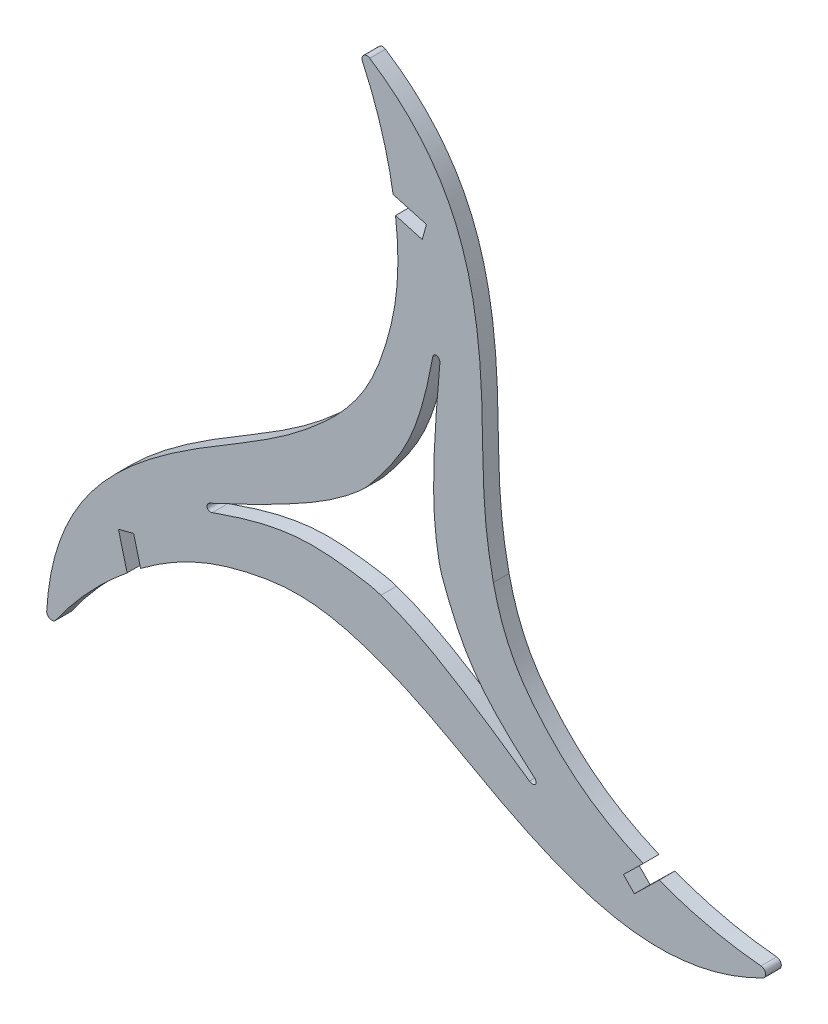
ISO-10303-21;
HEADER;
FILE_DESCRIPTION(('STEP AP214'),'2;1');
FILE_NAME('part.step','',(''),(''),'','','');
FILE_SCHEMA(('AUTOMOTIVE_DESIGN { 1 0 10303 214 1 1 1 1 }'));
ENDSEC;
DATA;
#1=APPLICATION_CONTEXT('core data for automotive mechanical design processes');
#2=APPLICATION_PROTOCOL_DEFINITION('international standard','automotive_design',2000,#1);
#3=PRODUCT_CONTEXT('',#1,'mechanical');
#4=PRODUCT('Part','Part','',(#3));
#5=PRODUCT_RELATED_PRODUCT_CATEGORY('part','',(#4));
#6=PRODUCT_DEFINITION_FORMATION('','',#4);
#7=PRODUCT_DEFINITION_CONTEXT('part definition',#1,'design');
#8=PRODUCT_DEFINITION('design','',#6,#7);
#9=PRODUCT_DEFINITION_SHAPE('','',#8);
#10=(LENGTH_UNIT() NAMED_UNIT(*) SI_UNIT(.MILLI.,.METRE.));
#11=(NAMED_UNIT(*) PLANE_ANGLE_UNIT() SI_UNIT($,.RADIAN.));
#12=(NAMED_UNIT(*) SI_UNIT($,.STERADIAN.) SOLID_ANGLE_UNIT());
#13=UNCERTAINTY_MEASURE_WITH_UNIT(LENGTH_MEASURE(1.E-05),#10,'distance_accuracy_value','');
#14=(GEOMETRIC_REPRESENTATION_CONTEXT(3) GLOBAL_UNCERTAINTY_ASSIGNED_CONTEXT((#13)) GLOBAL_UNIT_ASSIGNED_CONTEXT((#10,
#11,#12)) REPRESENTATION_CONTEXT('',''));
#15=CARTESIAN_POINT('',(0.,0.,0.));
#16=DIRECTION('',(0.,0.,1.));
#17=DIRECTION('',(1.,0.,0.));
#18=AXIS2_PLACEMENT_3D('',#15,#16,#17);
#19=CARTESIAN_POINT('',(0.926911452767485,32.4373510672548,1.5875));
#20=DIRECTION('',(0.,0.,-1.));
#21=DIRECTION('',(-1.,0.,0.));
#22=AXIS2_PLACEMENT_3D('',#19,#20,#21);
#23=PLANE('',#22);
#24=DIRECTION('',(-0.268637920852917,-0.96324123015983,0.));
#25=VECTOR('',#24,1.);
#26=CARTESIAN_POINT('',(9.20919559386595,57.6988180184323,1.5875));
#27=LINE('',#26,#25);
#28=CARTESIAN_POINT('',(9.20919559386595,57.6988180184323,1.5875));
#29=VERTEX_POINT('',#28);
#30=CARTESIAN_POINT('',(8.35627020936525,54.6405271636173,1.5875));
#31=VERTEX_POINT('',#30);
#32=EDGE_CURVE('E478',#29,#31,#27,.T.);
#33=ORIENTED_EDGE('',*,*,#32,.T.);
#34=DIRECTION('',(-0.96324123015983,0.268637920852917,0.));
#35=VECTOR('',#34,1.);
#36=CARTESIAN_POINT('',(2.96121667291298,56.1451512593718,1.5875));
#37=LINE('',#36,#35);
#38=CARTESIAN_POINT('',(2.96121667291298,56.1451512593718,1.5875));
#39=VERTEX_POINT('',#38);
#40=EDGE_CURVE('E638',#31,#39,#37,.T.);
#41=ORIENTED_EDGE('',*,*,#40,.T.);
#42=CARTESIAN_POINT('',(2.96121667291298,56.1451512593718,1.5875));
#43=CARTESIAN_POINT('',(3.0786080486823,55.1706324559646,1.5875));
#44=CARTESIAN_POINT('',(4.10490602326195,44.9116408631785,1.5875));
#45=CARTESIAN_POINT('',(1.28486234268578,31.0467796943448,1.5875));
#46=CARTESIAN_POINT('',(-4.0390919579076,19.6200508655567,1.5875));
#47=CARTESIAN_POINT('',(-11.3826186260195,12.8979686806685,1.5875));
#48=B_SPLINE_CURVE_WITH_KNOTS('',3,(#42,#43,#44,#45,#46,#47),.UNSPECIFIED.,.F.,.F.,(4,1,1,4),
(-8.31825161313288,-8.21573637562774,-7.21573637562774,-6.21573637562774),.UNSPECIFIED.);
#49=CARTESIAN_POINT('',(-11.3826186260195,12.8979686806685,1.5875));
#50=VERTEX_POINT('',#49);
#51=EDGE_CURVE('E541',#39,#50,#48,.T.);
#52=ORIENTED_EDGE('',*,*,#51,.T.);
#53=CARTESIAN_POINT('',(-11.3826186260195,12.8979686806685,1.5875));
#54=CARTESIAN_POINT('',(-19.3835443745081,5.57411968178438,1.5875));
#55=CARTESIAN_POINT('',(-34.0294843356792,-2.12221700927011,1.5875));
#56=CARTESIAN_POINT('',(-59.3228553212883,-19.5329214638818,1.5875));
#57=CARTESIAN_POINT('',(-66.9552211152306,-37.4553648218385,1.5875));
#58=CARTESIAN_POINT('',(-67.55052093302,-48.3844218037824,1.5875));
#59=B_SPLINE_CURVE_WITH_KNOTS('',3,(#53,#54,#55,#56,#57,#58),.UNSPECIFIED.,.F.,.F.,(4,1,1,4),
(-11.2199454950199,-10.2199454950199,-9.21994549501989,-8.31825161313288),.UNSPECIFIED.);
#60=CARTESIAN_POINT('',(-67.55052093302,-48.3844218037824,1.5875));
#61=VERTEX_POINT('',#60);
#62=EDGE_CURVE('E559',#50,#61,#59,.T.);
#63=ORIENTED_EDGE('',*,*,#62,.T.);
#64=CARTESIAN_POINT('',(-67.55052093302,-48.3844218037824,1.5875));
#65=CARTESIAN_POINT('',(-67.5924278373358,-49.1537869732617,1.5875));
#66=CARTESIAN_POINT('',(-66.862884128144,-49.4016678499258,1.5875));
#67=(BOUNDED_CURVE() B_SPLINE_CURVE(2,(#64,#65,#66),.UNSPECIFIED.,.F.,
.F.) B_SPLINE_CURVE_WITH_KNOTS((3,3),(0.,0.051907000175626),
.UNSPECIFIED.) CURVE() GEOMETRIC_REPRESENTATION_ITEM() RATIONAL_B_SPLINE_CURVE((1.,
0.796786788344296,1.)) REPRESENTATION_ITEM(''));
#68=CARTESIAN_POINT('',(-66.862884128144,-49.4016678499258,1.5875));
#69=VERTEX_POINT('',#68);
#70=EDGE_CURVE('E556',#61,#69,#67,.T.);
#71=ORIENTED_EDGE('',*,*,#70,.T.);
#72=CARTESIAN_POINT('',(-66.862884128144,-49.4016678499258,1.5875));
#73=CARTESIAN_POINT('',(-66.1333404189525,-49.64954872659,1.5875));
#74=CARTESIAN_POINT('',(-65.6978616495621,-49.0139095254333,1.5875));
#75=(BOUNDED_CURVE() B_SPLINE_CURVE(2,(#72,#73,#74),.UNSPECIFIED.,.F.,
.F.) B_SPLINE_CURVE_WITH_KNOTS((3,3),(0.,0.051907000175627),
.UNSPECIFIED.) CURVE() GEOMETRIC_REPRESENTATION_ITEM() RATIONAL_B_SPLINE_CURVE((1.,
0.796786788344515,1.)) REPRESENTATION_ITEM(''));
#76=CARTESIAN_POINT('',(-65.6978616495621,-49.0139095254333,1.5875));
#77=VERTEX_POINT('',#76);
#78=EDGE_CURVE('E558',#69,#77,#75,.T.);
#79=ORIENTED_EDGE('',*,*,#78,.T.);
#80=CARTESIAN_POINT('',(-65.6978616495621,-49.0139095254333,1.5875));
#81=CARTESIAN_POINT('',(-59.5706577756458,-40.2896872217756,1.5875));
#82=CARTESIAN_POINT('',(-51.3036177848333,-33.5583625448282,1.5875));
#83=(BOUNDED_CURVE() B_SPLINE_CURVE(2,(#80,#81,#82),.UNSPECIFIED.,.F.,
.F.) B_SPLINE_CURVE_WITH_KNOTS((3,3),(0.,0.83413775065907),
.UNSPECIFIED.) CURVE() GEOMETRIC_REPRESENTATION_ITEM() RATIONAL_B_SPLINE_CURVE((1.,
0.990551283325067,1.)) REPRESENTATION_ITEM(''));
#84=CARTESIAN_POINT('',(-51.3036177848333,-33.5583625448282,1.5875));
#85=VERTEX_POINT('',#84);
#86=EDGE_CURVE('E561',#77,#85,#83,.T.);
#87=ORIENTED_EDGE('',*,*,#86,.T.);
#88=DIRECTION('',(-0.248973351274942,0.968510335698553,0.));
#89=VECTOR('',#88,1.);
#90=CARTESIAN_POINT('',(-53.0457811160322,-26.7813192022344,1.5875));
#91=LINE('',#90,#89);
#92=CARTESIAN_POINT('',(-53.0457811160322,-26.7813192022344,1.5875));
#93=VERTEX_POINT('',#92);
#94=EDGE_CURVE('E582',#85,#93,#91,.T.);
#95=ORIENTED_EDGE('',*,*,#94,.T.);
#96=DIRECTION('',(0.968510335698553,0.248973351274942,0.));
#97=VECTOR('',#96,1.);
#98=CARTESIAN_POINT('',(-53.0457811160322,-26.7813192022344,1.5875));
#99=LINE('',#98,#97);
#100=CARTESIAN_POINT('',(-49.9707608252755,-25.9908288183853,1.5875));
#101=VERTEX_POINT('',#100);
#102=EDGE_CURVE('E587',#93,#101,#99,.T.);
#103=ORIENTED_EDGE('',*,*,#102,.T.);
#104=DIRECTION('',(0.248973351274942,-0.968510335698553,0.));
#105=VECTOR('',#104,1.);
#106=CARTESIAN_POINT('',(-49.9707608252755,-25.9908288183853,1.5875));
#107=LINE('',#106,#105);
#108=CARTESIAN_POINT('',(-48.5762767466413,-31.4153942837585,1.5875));
#109=VERTEX_POINT('',#108);
#110=EDGE_CURVE('E589',#101,#109,#107,.T.);
#111=ORIENTED_EDGE('',*,*,#110,.T.);
#112=CARTESIAN_POINT('',(-48.5762767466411,-31.4153942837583,1.5875));
#113=CARTESIAN_POINT('',(-47.7910143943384,-30.8264709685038,1.5875));
#114=CARTESIAN_POINT('',(-39.419616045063,-24.8081750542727,1.5875));
#115=CARTESIAN_POINT('',(-26.0022722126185,-20.3179739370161,1.5875));
#116=CARTESIAN_POINT('',(-13.4444576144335,-19.2152891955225,1.5875));
#117=CARTESIAN_POINT('',(-3.95120034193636,-22.2139287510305,1.5875));
#118=B_SPLINE_CURVE_WITH_KNOTS('',3,(#112,#113,#114,#115,#116,#117),.UNSPECIFIED.,.F.,.F.,(4,1,
1,4),(-14.7132301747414,-14.6107149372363,-13.6107149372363,-12.6107149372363),.UNSPECIFIED.);
#119=CARTESIAN_POINT('',(-3.95120034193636,-22.2139287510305,1.5875));
#120=VERTEX_POINT('',#119);
#121=EDGE_CURVE('E591',#109,#120,#118,.T.);
#122=ORIENTED_EDGE('',*,*,#121,.T.);
#123=CARTESIAN_POINT('',(-3.95120034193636,-22.2139287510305,1.5875));
#124=CARTESIAN_POINT('',(6.39190181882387,-25.4810092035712,1.5875));
#125=CARTESIAN_POINT('',(20.3800948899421,-34.3165969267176,1.5875));
#126=CARTESIAN_POINT('',(48.1048927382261,-47.5159465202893,1.5875));
#127=CARTESIAN_POINT('',(67.4423668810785,-45.1645475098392,1.5875));
#128=CARTESIAN_POINT('',(77.2048577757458,-40.2155637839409,1.5875));
#129=B_SPLINE_CURVE_WITH_KNOTS('',3,(#123,#124,#125,#126,#127,#128),.UNSPECIFIED.,.F.,.F.,(4,1,
1,4),(-17.6149240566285,-16.6149240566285,-15.6149240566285,-14.7132301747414),.UNSPECIFIED.);
#130=CARTESIAN_POINT('',(77.2048577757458,-40.2155637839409,1.5875));
#131=VERTEX_POINT('',#130);
#132=EDGE_CURVE('E596',#120,#131,#129,.T.);
#133=ORIENTED_EDGE('',*,*,#132,.T.);
#134=CARTESIAN_POINT('',(77.2048577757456,-40.2155637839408,1.5875));
#135=CARTESIAN_POINT('',(77.8921010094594,-39.867173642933,1.5875));
#136=CARTESIAN_POINT('',(77.7420002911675,-39.1114298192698,1.5875));
#137=(BOUNDED_CURVE() B_SPLINE_CURVE(2,(#134,#135,#136),.UNSPECIFIED.,.F.,
.F.) B_SPLINE_CURVE_WITH_KNOTS((3,3),(0.,0.0519070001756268),
.UNSPECIFIED.) CURVE() GEOMETRIC_REPRESENTATION_ITEM() RATIONAL_B_SPLINE_CURVE((1.,
0.796786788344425,1.)) REPRESENTATION_ITEM(''));
#138=CARTESIAN_POINT('',(77.7420002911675,-39.1114298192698,1.5875));
#139=VERTEX_POINT('',#138);
#140=EDGE_CURVE('E1062',#131,#139,#137,.T.);
#141=ORIENTED_EDGE('',*,*,#140,.T.);
#142=CARTESIAN_POINT('',(77.7420002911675,-39.1114298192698,1.5875));
#143=CARTESIAN_POINT('',(77.5918995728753,-38.3556859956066,1.5875));
#144=CARTESIAN_POINT('',(76.8236804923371,-38.2963699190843,1.5875));
#145=(BOUNDED_CURVE() B_SPLINE_CURVE(2,(#142,#143,#144),.UNSPECIFIED.,.F.,
.F.) B_SPLINE_CURVE_WITH_KNOTS((3,3),(0.,0.051907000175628),
.UNSPECIFIED.) CURVE() GEOMETRIC_REPRESENTATION_ITEM() RATIONAL_B_SPLINE_CURVE((1.,
0.796786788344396,1.)) REPRESENTATION_ITEM(''));
#146=CARTESIAN_POINT('',(76.8236804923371,-38.2963699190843,1.5875));
#147=VERTEX_POINT('',#146);
#148=EDGE_CURVE('E1079',#139,#147,#145,.T.);
#149=ORIENTED_EDGE('',*,*,#148,.T.);
#150=CARTESIAN_POINT('',(76.8236804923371,-38.2963699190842,1.5875));
#151=CARTESIAN_POINT('',(66.2046804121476,-37.3521668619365,1.5875));
#152=CARTESIAN_POINT('',(56.2416622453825,-33.5583625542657,1.5875));
#153=(BOUNDED_CURVE() B_SPLINE_CURVE(2,(#150,#151,#152),.UNSPECIFIED.,.F.,
.F.) B_SPLINE_CURVE_WITH_KNOTS((3,3),(0.,0.834137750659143),
.UNSPECIFIED.) CURVE() GEOMETRIC_REPRESENTATION_ITEM() RATIONAL_B_SPLINE_CURVE((1.,
0.990551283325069,1.)) REPRESENTATION_ITEM(''));
#154=CARTESIAN_POINT('',(56.2416622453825,-33.5583625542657,1.5875));
#155=VERTEX_POINT('',#154);
#156=EDGE_CURVE('E1054',#147,#155,#153,.T.);
#157=ORIENTED_EDGE('',*,*,#156,.T.);
#158=DIRECTION('',(-0.714267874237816,-0.699872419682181,0.));
#159=VECTOR('',#158,1.);
#160=CARTESIAN_POINT('',(51.2436522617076,-38.4556419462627,1.5875));
#161=LINE('',#160,#159);
#162=CARTESIAN_POINT('',(51.2436522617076,-38.4556419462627,1.5875));
#163=VERTEX_POINT('',#162);
#164=EDGE_CURVE('E1051',#155,#163,#161,.T.);
#165=ORIENTED_EDGE('',*,*,#164,.T.);
#166=DIRECTION('',(-0.699872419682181,0.714267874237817,0.));
#167=VECTOR('',#166,1.);
#168=CARTESIAN_POINT('',(49.0215573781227,-36.1878414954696,1.5875));
#169=LINE('',#168,#167);
#170=CARTESIAN_POINT('',(49.0215573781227,-36.1878414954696,1.5875));
#171=VERTEX_POINT('',#170);
#172=EDGE_CURVE('E1049',#163,#171,#169,.T.);
#173=ORIENTED_EDGE('',*,*,#172,.T.);
#174=DIRECTION('',(0.714267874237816,0.699872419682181,0.));
#175=VECTOR('',#174,1.);
#176=CARTESIAN_POINT('',(53.0221268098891,-32.2679000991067,1.5875));
#177=LINE('',#176,#175);
#178=CARTESIAN_POINT('',(53.0221268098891,-32.2679000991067,1.5875));
#179=VERTEX_POINT('',#178);
#180=EDGE_CURVE('E1041',#171,#179,#177,.T.);
#181=ORIENTED_EDGE('',*,*,#180,.T.);
#182=CARTESIAN_POINT('',(53.0221268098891,-32.2679000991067,1.5875));
#183=CARTESIAN_POINT('',(52.1194730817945,-31.882304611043,1.5875));
#184=CARTESIAN_POINT('',(42.7217767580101,-27.6416089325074,1.5875));
#185=CARTESIAN_POINT('',(32.1244766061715,-18.2669488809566,1.5875));
#186=CARTESIAN_POINT('',(24.8906163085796,-7.94290479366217,1.5875));
#187=CARTESIAN_POINT('',(22.7408857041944,1.7778169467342,1.5875));
#188=B_SPLINE_CURVE_WITH_KNOTS('',3,(#182,#183,#184,#185,#186,#187),.UNSPECIFIED.,.F.,.F.,(4,1,
1,4),(-21.1082087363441,-21.0056934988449,-20.0056934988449,-19.0056934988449),.UNSPECIFIED.);
#189=CARTESIAN_POINT('',(22.7408857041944,1.7778169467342,1.5875));
#190=VERTEX_POINT('',#189);
#191=EDGE_CURVE('E324',#179,#190,#188,.T.);
#192=ORIENTED_EDGE('',*,*,#191,.T.);
#193=CARTESIAN_POINT('',(22.7408857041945,1.77781694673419,1.5875));
#194=CARTESIAN_POINT('',(20.3987092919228,12.368746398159,1.5875));
#195=CARTESIAN_POINT('',(21.0564561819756,28.9006708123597,1.5875));
#196=CARTESIAN_POINT('',(18.6250293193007,59.5107248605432,1.5875));
#197=CARTESIAN_POINT('',(6.91992097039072,75.0817692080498,1.5875));
#198=CARTESIAN_POINT('',(-2.24727010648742,81.0618424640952,1.5875));
#199=B_SPLINE_CURVE_WITH_KNOTS('',3,(#193,#194,#195,#196,#197,#198),.UNSPECIFIED.,.F.,.F.,(4,1,
1,4),(-24.0099026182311,-23.0099026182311,-22.0099026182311,-21.1082087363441),.UNSPECIFIED.);
#200=CARTESIAN_POINT('',(-2.24727010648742,81.0618424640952,1.5875));
#201=VERTEX_POINT('',#200);
#202=EDGE_CURVE('E318',#190,#201,#199,.T.);
#203=ORIENTED_EDGE('',*,*,#202,.T.);
#204=CARTESIAN_POINT('',(-2.24727010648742,81.0618424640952,1.5875));
#205=CARTESIAN_POINT('',(-2.89260643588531,81.4828174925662,1.5875));
#206=CARTESIAN_POINT('',(-3.47204942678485,80.9749545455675,1.5875));
#207=(BOUNDED_CURVE() B_SPLINE_CURVE(2,(#204,#205,#206),.UNSPECIFIED.,.F.,
.F.) B_SPLINE_CURVE_WITH_KNOTS((3,3),(0.,0.0519070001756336),
.UNSPECIFIED.) CURVE() GEOMETRIC_REPRESENTATION_ITEM() RATIONAL_B_SPLINE_CURVE((1.,
0.796786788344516,1.)) REPRESENTATION_ITEM(''));
#208=CARTESIAN_POINT('',(-3.47204942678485,80.9749545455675,1.5875));
#209=VERTEX_POINT('',#208);
#210=EDGE_CURVE('E323',#201,#209,#207,.T.);
#211=ORIENTED_EDGE('',*,*,#210,.T.);
#212=CARTESIAN_POINT('',(-3.47204942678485,80.9749545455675,1.5875));
#213=CARTESIAN_POINT('',(-4.05149241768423,80.4670915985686,1.5875));
#214=CARTESIAN_POINT('',(-3.7187521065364,79.7721363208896,1.5875));
#215=(BOUNDED_CURVE() B_SPLINE_CURVE(2,(#212,#213,#214),.UNSPECIFIED.,.F.,
.F.) B_SPLINE_CURVE_WITH_KNOTS((3,3),(0.,0.051907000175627),
.UNSPECIFIED.) CURVE() GEOMETRIC_REPRESENTATION_ITEM() RATIONAL_B_SPLINE_CURVE((1.,
0.79678678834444,1.)) REPRESENTATION_ITEM(''));
#216=CARTESIAN_POINT('',(-3.7187521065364,79.7721363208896,1.5875));
#217=VERTEX_POINT('',#216);
#218=EDGE_CURVE('E335',#209,#217,#215,.T.);
#219=ORIENTED_EDGE('',*,*,#218,.T.);
#220=CARTESIAN_POINT('',(-3.7187521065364,79.7721363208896,1.5875));
#221=CARTESIAN_POINT('',(0.773044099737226,70.1037109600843,1.5875));
#222=CARTESIAN_POINT('',(2.46902227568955,59.578581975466,1.5875));
#223=(BOUNDED_CURVE() B_SPLINE_CURVE(2,(#220,#221,#222),.UNSPECIFIED.,.F.,
.F.) B_SPLINE_CURVE_WITH_KNOTS((3,3),(0.,0.83413775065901),
.UNSPECIFIED.) CURVE() GEOMETRIC_REPRESENTATION_ITEM() RATIONAL_B_SPLINE_CURVE((1.,
0.990551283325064,1.)) REPRESENTATION_ITEM(''));
#224=CARTESIAN_POINT('',(2.46902227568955,59.578581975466,1.5875));
#225=VERTEX_POINT('',#224);
#226=EDGE_CURVE('E342',#217,#225,#223,.T.);
#227=ORIENTED_EDGE('',*,*,#226,.T.);
#228=DIRECTION('',(0.96324123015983,-0.268637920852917,0.));
#229=VECTOR('',#228,1.);
#230=CARTESIAN_POINT('',(2.46902227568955,59.578581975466,1.5875));
#231=LINE('',#230,#229);
#232=EDGE_CURVE('E349',#225,#29,#231,.T.);
#233=ORIENTED_EDGE('',*,*,#232,.T.);
#234=EDGE_LOOP('',(#33,#41,#52,#63,#71,#79,#87,#95,#103,#111,#122,#133,#141,#149,#157,#165,#173,
#181,#192,#203,#211,#219,#227,#233));
#235=FACE_BOUND('',#234,.T.);
#236=CARTESIAN_POINT('',(10.4643405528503,35.0776449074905,1.5875));
#237=CARTESIAN_POINT('',(7.76222486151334,20.442368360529,1.5875));
#238=CARTESIAN_POINT('',(4.19404610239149,14.4563688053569,1.5875));
#239=CARTESIAN_POINT('',(-2.93233944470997,5.50174811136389,1.5875));
#240=CARTESIAN_POINT('',(-4.35214904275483,4.27647202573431,1.5875));
#241=B_SPLINE_CURVE_WITH_KNOTS('',3,(#236,#237,#238,#239,#240),.UNSPECIFIED.,.F.,.F.,(4,1,4),
(6.03518366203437,6.79414919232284,6.95151156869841),.UNSPECIFIED.);
#242=CARTESIAN_POINT('',(10.4643405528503,35.0776449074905,1.5875));
#243=VERTEX_POINT('',#242);
#244=CARTESIAN_POINT('',(-4.35214904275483,4.27647202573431,1.5875));
#245=VERTEX_POINT('',#244);
#246=EDGE_CURVE('E245',#243,#245,#241,.T.);
#247=ORIENTED_EDGE('',*,*,#246,.F.);
#248=CARTESIAN_POINT('',(11.9219547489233,34.7695839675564,1.5875));
#249=CARTESIAN_POINT('',(11.9355184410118,34.9201555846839,1.5875));
#250=CARTESIAN_POINT('',(12.0392274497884,36.0901645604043,1.5875));
#251=CARTESIAN_POINT('',(10.6355004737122,36.3908626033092,1.5875));
#252=CARTESIAN_POINT('',(10.4925085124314,35.2302090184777,1.5875));
#253=CARTESIAN_POINT('',(10.4643405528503,35.0776449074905,1.5875));
#254=B_SPLINE_CURVE_WITH_KNOTS('',5,(#248,#249,#250,#251,#252,#253),.UNSPECIFIED.,.F.,.F.,(6,6),
(5.03518366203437,6.03518366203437),.UNSPECIFIED.);
#255=CARTESIAN_POINT('',(11.9219547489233,34.7695839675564,1.5875));
#256=VERTEX_POINT('',#255);
#257=EDGE_CURVE('E658',#256,#243,#254,.T.);
#258=ORIENTED_EDGE('',*,*,#257,.F.);
#259=CARTESIAN_POINT('',(11.759215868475,0.,1.5875));
#260=CARTESIAN_POINT('',(10.5351236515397,6.42072739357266,1.5875));
#261=CARTESIAN_POINT('',(9.99544633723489,13.3832619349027,1.5875));
#262=CARTESIAN_POINT('',(11.9219547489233,34.7695839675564,1.5875));
#263=B_SPLINE_CURVE_WITH_KNOTS('',3,(#259,#260,#261,#262),.UNSPECIFIED.,.F.,.F.,(4,4),
(4.43391973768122,5.03518366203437),.UNSPECIFIED.);
#264=CARTESIAN_POINT('',(11.759215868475,0.,1.5875));
#265=VERTEX_POINT('',#264);
#266=EDGE_CURVE('E730',#265,#256,#263,.T.);
#267=ORIENTED_EDGE('',*,*,#266,.F.);
#268=CARTESIAN_POINT('',(31.0255692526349,-28.2320428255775,1.5875));
#269=CARTESIAN_POINT('',(19.7021058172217,-18.5743037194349,1.5875));
#270=CARTESIAN_POINT('',(16.3021675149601,-12.4911704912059,1.5875));
#271=CARTESIAN_POINT('',(12.1104312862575,-1.84222922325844,1.5875));
#272=CARTESIAN_POINT('',(11.759215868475,0.,1.5875));
#273=B_SPLINE_CURVE_WITH_KNOTS('',3,(#268,#269,#270,#271,#272),.UNSPECIFIED.,.F.,.F.,(4,1,4),
(3.51759183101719,4.27655736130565,4.43391973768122),.UNSPECIFIED.);
#274=CARTESIAN_POINT('',(31.0255692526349,-28.2320428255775,1.5875));
#275=VERTEX_POINT('',#274);
#276=EDGE_CURVE('E753',#275,#265,#273,.T.);
#277=ORIENTED_EDGE('',*,*,#276,.F.);
#278=CARTESIAN_POINT('',(30.0299735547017,-29.3403432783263,1.5875));
#279=CARTESIAN_POINT('',(30.1535905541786,-29.4273755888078,1.5875));
#280=CARTESIAN_POINT('',(31.1149935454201,-30.1021947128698,1.5875));
#281=CARTESIAN_POINT('',(32.0772691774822,-29.0368805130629,1.5875));
#282=CARTESIAN_POINT('',(31.1436096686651,-28.3327190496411,1.5875));
#283=CARTESIAN_POINT('',(31.0255692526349,-28.2320428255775,1.5875));
#284=B_SPLINE_CURVE_WITH_KNOTS('',5,(#278,#279,#280,#281,#282,#283),.UNSPECIFIED.,.F.,.F.,(6,6),
(2.51759183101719,3.51759183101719),.UNSPECIFIED.);
#285=CARTESIAN_POINT('',(30.0299735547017,-29.3403432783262,1.5875));
#286=VERTEX_POINT('',#285);
#287=EDGE_CURVE('E757',#286,#275,#284,.T.);
#288=ORIENTED_EDGE('',*,*,#287,.F.);
#289=CARTESIAN_POINT('',(0.,-11.8146152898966,1.5875));
#290=CARTESIAN_POINT('',(6.17255914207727,-13.9648840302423,1.5875));
#291=CARTESIAN_POINT('',(12.4721295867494,-16.9787770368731,1.5875));
#292=CARTESIAN_POINT('',(30.0299735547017,-29.3403432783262,1.5875));
#293=B_SPLINE_CURVE_WITH_KNOTS('',3,(#289,#290,#291,#292),.UNSPECIFIED.,.F.,.F.,(4,4),
(1.91632790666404,2.51759183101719),.UNSPECIFIED.);
#294=CARTESIAN_POINT('',(0.,-11.8146152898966,1.5875));
#295=VERTEX_POINT('',#294);
#296=EDGE_CURVE('E765',#295,#286,#293,.T.);
#297=ORIENTED_EDGE('',*,*,#296,.F.);
#298=CARTESIAN_POINT('',(-34.0828429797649,-14.3837453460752,1.5875));
#299=CARTESIAN_POINT('',(-20.0572638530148,-9.40620790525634,1.5875));
#300=CARTESIAN_POINT('',(-13.0891467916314,-9.50334157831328,1.5875));
#301=CARTESIAN_POINT('',(-1.77102501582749,-11.1976621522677,1.5875));
#302=CARTESIAN_POINT('',(0.,-11.8146152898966,1.5875));
#303=B_SPLINE_CURVE_WITH_KNOTS('',3,(#298,#299,#300,#301,#302),.UNSPECIFIED.,.F.,.F.,(4,1,4),
(1.,1.75896553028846,1.91632790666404),.UNSPECIFIED.);
#304=CARTESIAN_POINT('',(-34.0828429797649,-14.3837453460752,1.5875));
#305=VERTEX_POINT('',#304);
#306=EDGE_CURVE('E268',#305,#295,#303,.T.);
#307=ORIENTED_EDGE('',*,*,#306,.F.);
#308=CARTESIAN_POINT('',(-34.5448614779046,-12.9673839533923,1.5875));
#309=CARTESIAN_POINT('',(-34.6820421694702,-13.0309232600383,1.5875));
#310=CARTESIAN_POINT('',(-35.7471541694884,-13.5261131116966,1.5875));
#311=CARTESIAN_POINT('',(-35.3057028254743,-14.8921253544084,1.5875));
#312=CARTESIAN_POINT('',(-34.2290513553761,-14.4356332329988,1.5875));
#313=CARTESIAN_POINT('',(-34.0828429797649,-14.3837453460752,1.5875));
#314=B_SPLINE_CURVE_WITH_KNOTS('',5,(#308,#309,#310,#311,#312,#313),.UNSPECIFIED.,.F.,.F.,(6,6),
(0.,1.),.UNSPECIFIED.);
#315=CARTESIAN_POINT('',(-34.5448614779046,-12.9673839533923,1.5875));
#316=VERTEX_POINT('',#315);
#317=EDGE_CURVE('E266',#316,#305,#314,.T.);
#318=ORIENTED_EDGE('',*,*,#317,.F.);
#319=CARTESIAN_POINT('',(-4.35214904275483,4.27647202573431,1.5875));
#320=CARTESIAN_POINT('',(-9.30061596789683,0.0060133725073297,1.5875));
#321=CARTESIAN_POINT('',(-15.0605090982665,-3.94262816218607,1.5875));
#322=CARTESIAN_POINT('',(-34.5448614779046,-12.9673839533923,1.5875));
#323=B_SPLINE_CURVE_WITH_KNOTS('',3,(#319,#320,#321,#322),.UNSPECIFIED.,.F.,.F.,(4,4),
(6.95151156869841,7.55277549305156),.UNSPECIFIED.);
#324=EDGE_CURVE('E253',#245,#316,#323,.T.);
#325=ORIENTED_EDGE('',*,*,#324,.F.);
#326=EDGE_LOOP('',(#247,#258,#267,#277,#288,#297,#307,#318,#325));
#327=FACE_BOUND('',#326,.T.);
#328=ADVANCED_FACE('F30',(#235,#327),#23,.F.);
#329=CARTESIAN_POINT('',(0.926911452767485,32.4373510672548,-1.5875));
#330=DIRECTION('',(0.,0.,-1.));
#331=DIRECTION('',(-1.,0.,0.));
#332=AXIS2_PLACEMENT_3D('',#329,#330,#331);
#333=PLANE('',#332);
#334=DIRECTION('',(-0.268637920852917,-0.96324123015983,0.));
#335=VECTOR('',#334,1.);
#336=CARTESIAN_POINT('',(9.20919559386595,57.6988180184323,-1.5875));
#337=LINE('',#336,#335);
#338=CARTESIAN_POINT('',(9.20919559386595,57.6988180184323,-1.5875));
#339=VERTEX_POINT('',#338);
#340=CARTESIAN_POINT('',(8.35627020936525,54.6405271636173,-1.5875));
#341=VERTEX_POINT('',#340);
#342=EDGE_CURVE('E261',#339,#341,#337,.T.);
#343=ORIENTED_EDGE('',*,*,#342,.F.);
#344=DIRECTION('',(0.96324123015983,-0.268637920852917,0.));
#345=VECTOR('',#344,1.);
#346=CARTESIAN_POINT('',(2.46902227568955,59.578581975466,-1.5875));
#347=LINE('',#346,#345);
#348=CARTESIAN_POINT('',(2.46902227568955,59.578581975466,-1.5875));
#349=VERTEX_POINT('',#348);
#350=EDGE_CURVE('E473',#349,#339,#347,.T.);
#351=ORIENTED_EDGE('',*,*,#350,.F.);
#352=CARTESIAN_POINT('',(-3.7187521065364,79.7721363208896,-1.5875));
#353=CARTESIAN_POINT('',(0.773044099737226,70.1037109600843,-1.5875));
#354=CARTESIAN_POINT('',(2.46902227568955,59.578581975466,-1.5875));
#355=(BOUNDED_CURVE() B_SPLINE_CURVE(2,(#352,#353,#354),.UNSPECIFIED.,.F.,
.F.) B_SPLINE_CURVE_WITH_KNOTS((3,3),(0.,0.83413775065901),
.UNSPECIFIED.) CURVE() GEOMETRIC_REPRESENTATION_ITEM() RATIONAL_B_SPLINE_CURVE((1.,
0.990551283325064,1.)) REPRESENTATION_ITEM(''));
#356=CARTESIAN_POINT('',(-3.7187521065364,79.7721363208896,-1.5875));
#357=VERTEX_POINT('',#356);
#358=EDGE_CURVE('E466',#357,#349,#355,.T.);
#359=ORIENTED_EDGE('',*,*,#358,.F.);
#360=CARTESIAN_POINT('',(-3.47204942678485,80.9749545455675,-1.5875));
#361=CARTESIAN_POINT('',(-4.05149241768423,80.4670915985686,-1.5875));
#362=CARTESIAN_POINT('',(-3.7187521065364,79.7721363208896,-1.5875));
#363=(BOUNDED_CURVE() B_SPLINE_CURVE(2,(#360,#361,#362),.UNSPECIFIED.,.F.,
.F.) B_SPLINE_CURVE_WITH_KNOTS((3,3),(0.,0.051907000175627),
.UNSPECIFIED.) CURVE() GEOMETRIC_REPRESENTATION_ITEM() RATIONAL_B_SPLINE_CURVE((1.,
0.79678678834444,1.)) REPRESENTATION_ITEM(''));
#364=CARTESIAN_POINT('',(-3.47204942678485,80.9749545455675,-1.5875));
#365=VERTEX_POINT('',#364);
#366=EDGE_CURVE('E459',#365,#357,#363,.T.);
#367=ORIENTED_EDGE('',*,*,#366,.F.);
#368=CARTESIAN_POINT('',(-2.24727010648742,81.0618424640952,-1.5875));
#369=CARTESIAN_POINT('',(-2.89260643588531,81.4828174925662,-1.5875));
#370=CARTESIAN_POINT('',(-3.47204942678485,80.9749545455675,-1.5875));
#371=(BOUNDED_CURVE() B_SPLINE_CURVE(2,(#368,#369,#370),.UNSPECIFIED.,.F.,
.F.) B_SPLINE_CURVE_WITH_KNOTS((3,3),(0.,0.0519070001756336),
.UNSPECIFIED.) CURVE() GEOMETRIC_REPRESENTATION_ITEM() RATIONAL_B_SPLINE_CURVE((1.,
0.796786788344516,1.)) REPRESENTATION_ITEM(''));
#372=CARTESIAN_POINT('',(-2.24727010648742,81.0618424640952,-1.5875));
#373=VERTEX_POINT('',#372);
#374=EDGE_CURVE('E452',#373,#365,#371,.T.);
#375=ORIENTED_EDGE('',*,*,#374,.F.);
#376=CARTESIAN_POINT('',(22.7408857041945,1.77781694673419,-1.5875));
#377=CARTESIAN_POINT('',(20.3987092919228,12.368746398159,-1.5875));
#378=CARTESIAN_POINT('',(21.0564561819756,28.9006708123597,-1.5875));
#379=CARTESIAN_POINT('',(18.6250293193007,59.5107248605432,-1.5875));
#380=CARTESIAN_POINT('',(6.91992097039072,75.0817692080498,-1.5875));
#381=CARTESIAN_POINT('',(-2.24727010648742,81.0618424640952,-1.5875));
#382=B_SPLINE_CURVE_WITH_KNOTS('',3,(#376,#377,#378,#379,#380,#381),.UNSPECIFIED.,.F.,.F.,(4,1,
1,4),(-24.0099026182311,-23.0099026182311,-22.0099026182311,-21.1082087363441),.UNSPECIFIED.);
#383=CARTESIAN_POINT('',(22.7408857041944,1.7778169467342,-1.5875));
#384=VERTEX_POINT('',#383);
#385=EDGE_CURVE('E445',#384,#373,#382,.T.);
#386=ORIENTED_EDGE('',*,*,#385,.F.);
#387=CARTESIAN_POINT('',(53.0221268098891,-32.2679000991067,-1.5875));
#388=CARTESIAN_POINT('',(52.1194730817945,-31.882304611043,-1.5875));
#389=CARTESIAN_POINT('',(42.7217767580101,-27.6416089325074,-1.5875));
#390=CARTESIAN_POINT('',(32.1244766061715,-18.2669488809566,-1.5875));
#391=CARTESIAN_POINT('',(24.8906163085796,-7.94290479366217,-1.5875));
#392=CARTESIAN_POINT('',(22.7408857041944,1.7778169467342,-1.5875));
#393=B_SPLINE_CURVE_WITH_KNOTS('',3,(#387,#388,#389,#390,#391,#392),.UNSPECIFIED.,.F.,.F.,(4,1,
1,4),(-21.1082087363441,-21.0056934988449,-20.0056934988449,-19.0056934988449),.UNSPECIFIED.);
#394=CARTESIAN_POINT('',(53.0221268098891,-32.2679000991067,-1.5875));
#395=VERTEX_POINT('',#394);
#396=EDGE_CURVE('E441',#395,#384,#393,.T.);
#397=ORIENTED_EDGE('',*,*,#396,.F.);
#398=DIRECTION('',(0.714267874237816,0.699872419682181,0.));
#399=VECTOR('',#398,1.);
#400=CARTESIAN_POINT('',(53.0221268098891,-32.2679000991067,-1.5875));
#401=LINE('',#400,#399);
#402=CARTESIAN_POINT('',(49.0215573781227,-36.1878414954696,-1.5875));
#403=VERTEX_POINT('',#402);
#404=EDGE_CURVE('E439',#403,#395,#401,.T.);
#405=ORIENTED_EDGE('',*,*,#404,.F.);
#406=DIRECTION('',(-0.699872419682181,0.714267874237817,0.));
#407=VECTOR('',#406,1.);
#408=CARTESIAN_POINT('',(49.0215573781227,-36.1878414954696,-1.5875));
#409=LINE('',#408,#407);
#410=CARTESIAN_POINT('',(51.2436522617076,-38.4556419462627,-1.5875));
#411=VERTEX_POINT('',#410);
#412=EDGE_CURVE('E437',#411,#403,#409,.T.);
#413=ORIENTED_EDGE('',*,*,#412,.F.);
#414=DIRECTION('',(-0.714267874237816,-0.699872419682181,0.));
#415=VECTOR('',#414,1.);
#416=CARTESIAN_POINT('',(51.2436522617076,-38.4556419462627,-1.5875));
#417=LINE('',#416,#415);
#418=CARTESIAN_POINT('',(56.2416622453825,-33.5583625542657,-1.5875));
#419=VERTEX_POINT('',#418);
#420=EDGE_CURVE('E432',#419,#411,#417,.T.);
#421=ORIENTED_EDGE('',*,*,#420,.F.);
#422=CARTESIAN_POINT('',(76.8236804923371,-38.2963699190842,-1.5875));
#423=CARTESIAN_POINT('',(66.2046804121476,-37.3521668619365,-1.5875));
#424=CARTESIAN_POINT('',(56.2416622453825,-33.5583625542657,-1.5875));
#425=(BOUNDED_CURVE() B_SPLINE_CURVE(2,(#422,#423,#424),.UNSPECIFIED.,.F.,
.F.) B_SPLINE_CURVE_WITH_KNOTS((3,3),(0.,0.834137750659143),
.UNSPECIFIED.) CURVE() GEOMETRIC_REPRESENTATION_ITEM() RATIONAL_B_SPLINE_CURVE((1.,
0.990551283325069,1.)) REPRESENTATION_ITEM(''));
#426=CARTESIAN_POINT('',(76.8236804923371,-38.2963699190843,-1.5875));
#427=VERTEX_POINT('',#426);
#428=EDGE_CURVE('E425',#427,#419,#425,.T.);
#429=ORIENTED_EDGE('',*,*,#428,.F.);
#430=CARTESIAN_POINT('',(77.7420002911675,-39.1114298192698,-1.5875));
#431=CARTESIAN_POINT('',(77.5918995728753,-38.3556859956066,-1.5875));
#432=CARTESIAN_POINT('',(76.8236804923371,-38.2963699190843,-1.5875));
#433=(BOUNDED_CURVE() B_SPLINE_CURVE(2,(#430,#431,#432),.UNSPECIFIED.,.F.,
.F.) B_SPLINE_CURVE_WITH_KNOTS((3,3),(0.,0.051907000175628),
.UNSPECIFIED.) CURVE() GEOMETRIC_REPRESENTATION_ITEM() RATIONAL_B_SPLINE_CURVE((1.,
0.796786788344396,1.)) REPRESENTATION_ITEM(''));
#434=CARTESIAN_POINT('',(77.7420002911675,-39.1114298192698,-1.5875));
#435=VERTEX_POINT('',#434);
#436=EDGE_CURVE('E418',#435,#427,#433,.T.);
#437=ORIENTED_EDGE('',*,*,#436,.F.);
#438=CARTESIAN_POINT('',(77.2048577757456,-40.2155637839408,-1.5875));
#439=CARTESIAN_POINT('',(77.8921010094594,-39.867173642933,-1.5875));
#440=CARTESIAN_POINT('',(77.7420002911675,-39.1114298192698,-1.5875));
#441=(BOUNDED_CURVE() B_SPLINE_CURVE(2,(#438,#439,#440),.UNSPECIFIED.,.F.,
.F.) B_SPLINE_CURVE_WITH_KNOTS((3,3),(0.,0.0519070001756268),
.UNSPECIFIED.) CURVE() GEOMETRIC_REPRESENTATION_ITEM() RATIONAL_B_SPLINE_CURVE((1.,
0.796786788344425,1.)) REPRESENTATION_ITEM(''));
#442=CARTESIAN_POINT('',(77.2048577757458,-40.2155637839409,-1.5875));
#443=VERTEX_POINT('',#442);
#444=EDGE_CURVE('E411',#443,#435,#441,.T.);
#445=ORIENTED_EDGE('',*,*,#444,.F.);
#446=CARTESIAN_POINT('',(-3.95120034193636,-22.2139287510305,-1.5875));
#447=CARTESIAN_POINT('',(6.39190181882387,-25.4810092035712,-1.5875));
#448=CARTESIAN_POINT('',(20.3800948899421,-34.3165969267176,-1.5875));
#449=CARTESIAN_POINT('',(48.1048927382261,-47.5159465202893,-1.5875));
#450=CARTESIAN_POINT('',(67.4423668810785,-45.1645475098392,-1.5875));
#451=CARTESIAN_POINT('',(77.2048577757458,-40.2155637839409,-1.5875));
#452=B_SPLINE_CURVE_WITH_KNOTS('',3,(#446,#447,#448,#449,#450,#451),.UNSPECIFIED.,.F.,.F.,(4,1,
1,4),(-17.6149240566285,-16.6149240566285,-15.6149240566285,-14.7132301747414),.UNSPECIFIED.);
#453=CARTESIAN_POINT('',(-3.95120034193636,-22.2139287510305,-1.5875));
#454=VERTEX_POINT('',#453);
#455=EDGE_CURVE('E404',#454,#443,#452,.T.);
#456=ORIENTED_EDGE('',*,*,#455,.F.);
#457=CARTESIAN_POINT('',(-48.5762767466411,-31.4153942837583,-1.5875));
#458=CARTESIAN_POINT('',(-47.7910143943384,-30.8264709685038,-1.5875));
#459=CARTESIAN_POINT('',(-39.419616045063,-24.8081750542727,-1.5875));
#460=CARTESIAN_POINT('',(-26.0022722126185,-20.3179739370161,-1.5875));
#461=CARTESIAN_POINT('',(-13.4444576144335,-19.2152891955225,-1.5875));
#462=CARTESIAN_POINT('',(-3.95120034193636,-22.2139287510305,-1.5875));
#463=B_SPLINE_CURVE_WITH_KNOTS('',3,(#457,#458,#459,#460,#461,#462),.UNSPECIFIED.,.F.,.F.,(4,1,
1,4),(-14.7132301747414,-14.6107149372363,-13.6107149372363,-12.6107149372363),.UNSPECIFIED.);
#464=CARTESIAN_POINT('',(-48.5762767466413,-31.4153942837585,-1.5875));
#465=VERTEX_POINT('',#464);
#466=EDGE_CURVE('E400',#465,#454,#463,.T.);
#467=ORIENTED_EDGE('',*,*,#466,.F.);
#468=DIRECTION('',(0.248973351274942,-0.968510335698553,0.));
#469=VECTOR('',#468,1.);
#470=CARTESIAN_POINT('',(-49.9707608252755,-25.9908288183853,-1.5875));
#471=LINE('',#470,#469);
#472=CARTESIAN_POINT('',(-49.9707608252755,-25.9908288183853,-1.5875));
#473=VERTEX_POINT('',#472);
#474=EDGE_CURVE('E398',#473,#465,#471,.T.);
#475=ORIENTED_EDGE('',*,*,#474,.F.);
#476=DIRECTION('',(0.968510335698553,0.248973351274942,0.));
#477=VECTOR('',#476,1.);
#478=CARTESIAN_POINT('',(-53.0457811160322,-26.7813192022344,-1.5875));
#479=LINE('',#478,#477);
#480=CARTESIAN_POINT('',(-53.0457811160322,-26.7813192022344,-1.5875));
#481=VERTEX_POINT('',#480);
#482=EDGE_CURVE('E396',#481,#473,#479,.T.);
#483=ORIENTED_EDGE('',*,*,#482,.F.);
#484=DIRECTION('',(-0.248973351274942,0.968510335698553,0.));
#485=VECTOR('',#484,1.);
#486=CARTESIAN_POINT('',(-53.0457811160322,-26.7813192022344,-1.5875));
#487=LINE('',#486,#485);
#488=CARTESIAN_POINT('',(-51.3036177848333,-33.5583625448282,-1.5875));
#489=VERTEX_POINT('',#488);
#490=EDGE_CURVE('E391',#489,#481,#487,.T.);
#491=ORIENTED_EDGE('',*,*,#490,.F.);
#492=CARTESIAN_POINT('',(-65.6978616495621,-49.0139095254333,-1.5875));
#493=CARTESIAN_POINT('',(-59.5706577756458,-40.2896872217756,-1.5875));
#494=CARTESIAN_POINT('',(-51.3036177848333,-33.5583625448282,-1.5875));
#495=(BOUNDED_CURVE() B_SPLINE_CURVE(2,(#492,#493,#494),.UNSPECIFIED.,.F.,
.F.) B_SPLINE_CURVE_WITH_KNOTS((3,3),(0.,0.83413775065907),
.UNSPECIFIED.) CURVE() GEOMETRIC_REPRESENTATION_ITEM() RATIONAL_B_SPLINE_CURVE((1.,
0.990551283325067,1.)) REPRESENTATION_ITEM(''));
#496=CARTESIAN_POINT('',(-65.6978616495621,-49.0139095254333,-1.5875));
#497=VERTEX_POINT('',#496);
#498=EDGE_CURVE('E384',#497,#489,#495,.T.);
#499=ORIENTED_EDGE('',*,*,#498,.F.);
#500=CARTESIAN_POINT('',(-66.862884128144,-49.4016678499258,-1.5875));
#501=CARTESIAN_POINT('',(-66.1333404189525,-49.64954872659,-1.5875));
#502=CARTESIAN_POINT('',(-65.6978616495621,-49.0139095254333,-1.5875));
#503=(BOUNDED_CURVE() B_SPLINE_CURVE(2,(#500,#501,#502),.UNSPECIFIED.,.F.,
.F.) B_SPLINE_CURVE_WITH_KNOTS((3,3),(0.,0.051907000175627),
.UNSPECIFIED.) CURVE() GEOMETRIC_REPRESENTATION_ITEM() RATIONAL_B_SPLINE_CURVE((1.,
0.796786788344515,1.)) REPRESENTATION_ITEM(''));
#504=CARTESIAN_POINT('',(-66.862884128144,-49.4016678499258,-1.5875));
#505=VERTEX_POINT('',#504);
#506=EDGE_CURVE('E377',#505,#497,#503,.T.);
#507=ORIENTED_EDGE('',*,*,#506,.F.);
#508=CARTESIAN_POINT('',(-67.55052093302,-48.3844218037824,-1.5875));
#509=CARTESIAN_POINT('',(-67.5924278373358,-49.1537869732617,-1.5875));
#510=CARTESIAN_POINT('',(-66.862884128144,-49.4016678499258,-1.5875));
#511=(BOUNDED_CURVE() B_SPLINE_CURVE(2,(#508,#509,#510),.UNSPECIFIED.,.F.,
.F.) B_SPLINE_CURVE_WITH_KNOTS((3,3),(0.,0.051907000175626),
.UNSPECIFIED.) CURVE() GEOMETRIC_REPRESENTATION_ITEM() RATIONAL_B_SPLINE_CURVE((1.,
0.796786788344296,1.)) REPRESENTATION_ITEM(''));
#512=CARTESIAN_POINT('',(-67.55052093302,-48.3844218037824,-1.5875));
#513=VERTEX_POINT('',#512);
#514=EDGE_CURVE('E370',#513,#505,#511,.T.);
#515=ORIENTED_EDGE('',*,*,#514,.F.);
#516=CARTESIAN_POINT('',(-11.3826186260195,12.8979686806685,-1.5875));
#517=CARTESIAN_POINT('',(-19.3835443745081,5.57411968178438,-1.5875));
#518=CARTESIAN_POINT('',(-34.0294843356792,-2.12221700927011,-1.5875));
#519=CARTESIAN_POINT('',(-59.3228553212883,-19.5329214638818,-1.5875));
#520=CARTESIAN_POINT('',(-66.9552211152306,-37.4553648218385,-1.5875));
#521=CARTESIAN_POINT('',(-67.55052093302,-48.3844218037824,-1.5875));
#522=B_SPLINE_CURVE_WITH_KNOTS('',3,(#516,#517,#518,#519,#520,#521),.UNSPECIFIED.,.F.,.F.,(4,1,
1,4),(-11.2199454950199,-10.2199454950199,-9.21994549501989,-8.31825161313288),.UNSPECIFIED.);
#523=CARTESIAN_POINT('',(-11.3826186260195,12.8979686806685,-1.5875));
#524=VERTEX_POINT('',#523);
#525=EDGE_CURVE('E363',#524,#513,#522,.T.);
#526=ORIENTED_EDGE('',*,*,#525,.F.);
#527=CARTESIAN_POINT('',(2.96121667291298,56.1451512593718,-1.5875));
#528=CARTESIAN_POINT('',(3.0786080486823,55.1706324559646,-1.5875));
#529=CARTESIAN_POINT('',(4.10490602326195,44.9116408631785,-1.5875));
#530=CARTESIAN_POINT('',(1.28486234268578,31.0467796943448,-1.5875));
#531=CARTESIAN_POINT('',(-4.0390919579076,19.6200508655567,-1.5875));
#532=CARTESIAN_POINT('',(-11.3826186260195,12.8979686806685,-1.5875));
#533=B_SPLINE_CURVE_WITH_KNOTS('',3,(#527,#528,#529,#530,#531,#532),.UNSPECIFIED.,.F.,.F.,(4,1,
1,4),(-8.31825161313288,-8.21573637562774,-7.21573637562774,-6.21573637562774),.UNSPECIFIED.);
#534=CARTESIAN_POINT('',(2.96121667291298,56.1451512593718,-1.5875));
#535=VERTEX_POINT('',#534);
#536=EDGE_CURVE('E359',#535,#524,#533,.T.);
#537=ORIENTED_EDGE('',*,*,#536,.F.);
#538=DIRECTION('',(-0.96324123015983,0.268637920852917,0.));
#539=VECTOR('',#538,1.);
#540=CARTESIAN_POINT('',(2.96121667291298,56.1451512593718,-1.5875));
#541=LINE('',#540,#539);
#542=EDGE_CURVE('E357',#341,#535,#541,.T.);
#543=ORIENTED_EDGE('',*,*,#542,.F.);
#544=EDGE_LOOP('',(#343,#351,#359,#367,#375,#386,#397,#405,#413,#421,#429,#437,#445,#456,#467,
#475,#483,#491,#499,#507,#515,#526,#537,#543));
#545=FACE_BOUND('',#544,.T.);
#546=CARTESIAN_POINT('',(11.9219547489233,34.7695839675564,-1.5875));
#547=CARTESIAN_POINT('',(11.9355184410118,34.9201555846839,-1.5875));
#548=CARTESIAN_POINT('',(12.0392274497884,36.0901645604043,-1.5875));
#549=CARTESIAN_POINT('',(10.6355004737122,36.3908626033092,-1.5875));
#550=CARTESIAN_POINT('',(10.4925085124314,35.2302090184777,-1.5875));
#551=CARTESIAN_POINT('',(10.4643405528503,35.0776449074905,-1.5875));
#552=B_SPLINE_CURVE_WITH_KNOTS('',5,(#546,#547,#548,#549,#550,#551),.UNSPECIFIED.,.F.,.F.,(6,6),
(5.03518366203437,6.03518366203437),.UNSPECIFIED.);
#553=CARTESIAN_POINT('',(11.9219547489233,34.7695839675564,-1.5875));
#554=VERTEX_POINT('',#553);
#555=CARTESIAN_POINT('',(10.4643405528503,35.0776449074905,-1.5875));
#556=VERTEX_POINT('',#555);
#557=EDGE_CURVE('E254',#554,#556,#552,.T.);
#558=ORIENTED_EDGE('',*,*,#557,.T.);
#559=CARTESIAN_POINT('',(10.4643405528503,35.0776449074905,-1.5875));
#560=CARTESIAN_POINT('',(7.76222486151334,20.442368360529,-1.5875));
#561=CARTESIAN_POINT('',(4.19404610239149,14.4563688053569,-1.5875));
#562=CARTESIAN_POINT('',(-2.93233944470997,5.50174811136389,-1.5875));
#563=CARTESIAN_POINT('',(-4.35214904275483,4.27647202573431,-1.5875));
#564=B_SPLINE_CURVE_WITH_KNOTS('',3,(#559,#560,#561,#562,#563),.UNSPECIFIED.,.F.,.F.,(4,1,4),
(6.03518366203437,6.79414919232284,6.95151156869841),.UNSPECIFIED.);
#565=CARTESIAN_POINT('',(-4.35214904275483,4.27647202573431,-1.5875));
#566=VERTEX_POINT('',#565);
#567=EDGE_CURVE('E53',#556,#566,#564,.T.);
#568=ORIENTED_EDGE('',*,*,#567,.T.);
#569=CARTESIAN_POINT('',(-4.35214904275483,4.27647202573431,-1.5875));
#570=CARTESIAN_POINT('',(-9.30061596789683,0.0060133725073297,-1.5875));
#571=CARTESIAN_POINT('',(-15.0605090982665,-3.94262816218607,-1.5875));
#572=CARTESIAN_POINT('',(-34.5448614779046,-12.9673839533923,-1.5875));
#573=B_SPLINE_CURVE_WITH_KNOTS('',3,(#569,#570,#571,#572),.UNSPECIFIED.,.F.,.F.,(4,4),
(6.95151156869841,7.55277549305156),.UNSPECIFIED.);
#574=CARTESIAN_POINT('',(-34.5448614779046,-12.9673839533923,-1.5875));
#575=VERTEX_POINT('',#574);
#576=EDGE_CURVE('E260',#566,#575,#573,.T.);
#577=ORIENTED_EDGE('',*,*,#576,.T.);
#578=CARTESIAN_POINT('',(-34.5448614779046,-12.9673839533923,-1.5875));
#579=CARTESIAN_POINT('',(-34.6820421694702,-13.0309232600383,-1.5875));
#580=CARTESIAN_POINT('',(-35.7471541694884,-13.5261131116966,-1.5875));
#581=CARTESIAN_POINT('',(-35.3057028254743,-14.8921253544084,-1.5875));
#582=CARTESIAN_POINT('',(-34.2290513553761,-14.4356332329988,-1.5875));
#583=CARTESIAN_POINT('',(-34.0828429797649,-14.3837453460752,-1.5875));
#584=B_SPLINE_CURVE_WITH_KNOTS('',5,(#578,#579,#580,#581,#582,#583),.UNSPECIFIED.,.F.,.F.,(6,6),
(0.,1.),.UNSPECIFIED.);
#585=CARTESIAN_POINT('',(-34.0828429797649,-14.3837453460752,-1.5875));
#586=VERTEX_POINT('',#585);
#587=EDGE_CURVE('E703',#575,#586,#584,.T.);
#588=ORIENTED_EDGE('',*,*,#587,.T.);
#589=CARTESIAN_POINT('',(-34.0828429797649,-14.3837453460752,-1.5875));
#590=CARTESIAN_POINT('',(-20.0572638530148,-9.40620790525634,-1.5875));
#591=CARTESIAN_POINT('',(-13.0891467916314,-9.50334157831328,-1.5875));
#592=CARTESIAN_POINT('',(-1.77102501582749,-11.1976621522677,-1.5875));
#593=CARTESIAN_POINT('',(0.,-11.8146152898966,-1.5875));
#594=B_SPLINE_CURVE_WITH_KNOTS('',3,(#589,#590,#591,#592,#593),.UNSPECIFIED.,.F.,.F.,(4,1,4),
(1.,1.75896553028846,1.91632790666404),.UNSPECIFIED.);
#595=CARTESIAN_POINT('',(0.,-11.8146152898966,-1.5875));
#596=VERTEX_POINT('',#595);
#597=EDGE_CURVE('E695',#586,#596,#594,.T.);
#598=ORIENTED_EDGE('',*,*,#597,.T.);
#599=CARTESIAN_POINT('',(0.,-11.8146152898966,-1.5875));
#600=CARTESIAN_POINT('',(6.17255914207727,-13.9648840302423,-1.5875));
#601=CARTESIAN_POINT('',(12.4721295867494,-16.9787770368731,-1.5875));
#602=CARTESIAN_POINT('',(30.0299735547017,-29.3403432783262,-1.5875));
#603=B_SPLINE_CURVE_WITH_KNOTS('',3,(#599,#600,#601,#602),.UNSPECIFIED.,.F.,.F.,(4,4),
(1.91632790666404,2.51759183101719),.UNSPECIFIED.);
#604=CARTESIAN_POINT('',(30.0299735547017,-29.3403432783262,-1.5875));
#605=VERTEX_POINT('',#604);
#606=EDGE_CURVE('E687',#596,#605,#603,.T.);
#607=ORIENTED_EDGE('',*,*,#606,.T.);
#608=CARTESIAN_POINT('',(30.0299735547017,-29.3403432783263,-1.5875));
#609=CARTESIAN_POINT('',(30.1535905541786,-29.4273755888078,-1.5875));
#610=CARTESIAN_POINT('',(31.1149935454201,-30.1021947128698,-1.5875));
#611=CARTESIAN_POINT('',(32.0772691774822,-29.0368805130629,-1.5875));
#612=CARTESIAN_POINT('',(31.1436096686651,-28.3327190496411,-1.5875));
#613=CARTESIAN_POINT('',(31.0255692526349,-28.2320428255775,-1.5875));
#614=B_SPLINE_CURVE_WITH_KNOTS('',5,(#608,#609,#610,#611,#612,#613),.UNSPECIFIED.,.F.,.F.,(6,6),
(2.51759183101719,3.51759183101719),.UNSPECIFIED.);
#615=CARTESIAN_POINT('',(31.0255692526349,-28.2320428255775,-1.5875));
#616=VERTEX_POINT('',#615);
#617=EDGE_CURVE('E679',#605,#616,#614,.T.);
#618=ORIENTED_EDGE('',*,*,#617,.T.);
#619=CARTESIAN_POINT('',(31.0255692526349,-28.2320428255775,-1.5875));
#620=CARTESIAN_POINT('',(19.7021058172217,-18.5743037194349,-1.5875));
#621=CARTESIAN_POINT('',(16.3021675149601,-12.4911704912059,-1.5875));
#622=CARTESIAN_POINT('',(12.1104312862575,-1.84222922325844,-1.5875));
#623=CARTESIAN_POINT('',(11.759215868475,0.,-1.5875));
#624=B_SPLINE_CURVE_WITH_KNOTS('',3,(#619,#620,#621,#622,#623),.UNSPECIFIED.,.F.,.F.,(4,1,4),
(3.51759183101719,4.27655736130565,4.43391973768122),.UNSPECIFIED.);
#625=CARTESIAN_POINT('',(11.759215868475,0.,-1.5875));
#626=VERTEX_POINT('',#625);
#627=EDGE_CURVE('E671',#616,#626,#624,.T.);
#628=ORIENTED_EDGE('',*,*,#627,.T.);
#629=CARTESIAN_POINT('',(11.759215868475,0.,-1.5875));
#630=CARTESIAN_POINT('',(10.5351236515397,6.42072739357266,-1.5875));
#631=CARTESIAN_POINT('',(9.99544633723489,13.3832619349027,-1.5875));
#632=CARTESIAN_POINT('',(11.9219547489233,34.7695839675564,-1.5875));
#633=B_SPLINE_CURVE_WITH_KNOTS('',3,(#629,#630,#631,#632),.UNSPECIFIED.,.F.,.F.,(4,4),
(4.43391973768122,5.03518366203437),.UNSPECIFIED.);
#634=EDGE_CURVE('E663',#626,#554,#633,.T.);
#635=ORIENTED_EDGE('',*,*,#634,.T.);
#636=EDGE_LOOP('',(#558,#568,#577,#588,#598,#607,#618,#628,#635));
#637=FACE_BOUND('',#636,.T.);
#638=ADVANCED_FACE('F294',(#545,#637),#333,.T.);
#639=CARTESIAN_POINT('',(9.20919559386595,57.6988180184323,1.5875));
#640=DIRECTION('',(0.96324123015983,-0.268637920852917,0.));
#641=DIRECTION('',(0.268637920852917,0.96324123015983,0.));
#642=AXIS2_PLACEMENT_3D('',#639,#640,#641);
#643=PLANE('',#642);
#644=ORIENTED_EDGE('',*,*,#342,.T.);
#645=DIRECTION('',(0.,0.,-1.));
#646=VECTOR('',#645,1.);
#647=CARTESIAN_POINT('',(8.35627020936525,54.6405271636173,1.5875));
#648=LINE('',#647,#646);
#649=EDGE_CURVE('E11',#31,#341,#648,.T.);
#650=ORIENTED_EDGE('',*,*,#649,.F.);
#651=ORIENTED_EDGE('',*,*,#32,.F.);
#652=DIRECTION('',(0.,0.,-1.));
#653=VECTOR('',#652,1.);
#654=CARTESIAN_POINT('',(9.20919559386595,57.6988180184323,1.5875));
#655=LINE('',#654,#653);
#656=EDGE_CURVE('E354',#29,#339,#655,.T.);
#657=ORIENTED_EDGE('',*,*,#656,.T.);
#658=EDGE_LOOP('',(#644,#650,#651,#657));
#659=FACE_BOUND('',#658,.T.);
#660=ADVANCED_FACE('F32',(#659),#643,.F.);
#661=CARTESIAN_POINT('',(2.96121667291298,56.1451512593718,1.5875));
#662=DIRECTION('',(-0.268637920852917,-0.96324123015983,0.));
#663=DIRECTION('',(0.96324123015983,-0.268637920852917,0.));
#664=AXIS2_PLACEMENT_3D('',#661,#662,#663);
#665=PLANE('',#664);
#666=ORIENTED_EDGE('',*,*,#542,.T.);
#667=DIRECTION('',(0.,0.,-1.));
#668=VECTOR('',#667,1.);
#669=CARTESIAN_POINT('',(2.96121667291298,56.1451512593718,1.5875));
#670=LINE('',#669,#668);
#671=EDGE_CURVE('E38',#39,#535,#670,.T.);
#672=ORIENTED_EDGE('',*,*,#671,.F.);
#673=ORIENTED_EDGE('',*,*,#40,.F.);
#674=ORIENTED_EDGE('',*,*,#649,.T.);
#675=EDGE_LOOP('',(#666,#672,#673,#674));
#676=FACE_BOUND('',#675,.T.);
#677=ADVANCED_FACE('F633',(#676),#665,.F.);
#678=DIRECTION('',(0.,0.,-1.));
#679=VECTOR('',#678,1.);
#680=SURFACE_OF_LINEAR_EXTRUSION('',#48,#679);
#681=ORIENTED_EDGE('',*,*,#536,.T.);
#682=DIRECTION('',(0.,0.,-1.));
#683=VECTOR('',#682,1.);
#684=CARTESIAN_POINT('',(-11.3826186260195,12.8979686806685,1.5875));
#685=LINE('',#684,#683);
#686=EDGE_CURVE('E532',#50,#524,#685,.T.);
#687=ORIENTED_EDGE('',*,*,#686,.F.);
#688=ORIENTED_EDGE('',*,*,#51,.F.);
#689=ORIENTED_EDGE('',*,*,#671,.T.);
#690=EDGE_LOOP('',(#681,#687,#688,#689));
#691=FACE_BOUND('',#690,.T.);
#692=ADVANCED_FACE('F539',(#691),#680,.F.);
#693=DIRECTION('',(0.,0.,-1.));
#694=VECTOR('',#693,1.);
#695=SURFACE_OF_LINEAR_EXTRUSION('',#59,#694);
#696=ORIENTED_EDGE('',*,*,#525,.T.);
#697=DIRECTION('',(0.,0.,-1.));
#698=VECTOR('',#697,1.);
#699=CARTESIAN_POINT('',(-67.55052093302,-48.3844218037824,1.5875));
#700=LINE('',#699,#698);
#701=EDGE_CURVE('E529',#61,#513,#700,.T.);
#702=ORIENTED_EDGE('',*,*,#701,.F.);
#703=ORIENTED_EDGE('',*,*,#62,.F.);
#704=ORIENTED_EDGE('',*,*,#686,.T.);
#705=EDGE_LOOP('',(#696,#702,#703,#704));
#706=FACE_BOUND('',#705,.T.);
#707=ADVANCED_FACE('F550',(#706),#695,.F.);
#708=CARTESIAN_POINT('',(-66.5360247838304,-48.4396808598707,1.5875));
#709=DIRECTION('',(0.,0.,-1.));
#710=DIRECTION('',(-1.,0.,0.));
#711=AXIS2_PLACEMENT_3D('',#708,#709,#710);
#712=CYLINDRICAL_SURFACE('',#711,1.01600000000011);
#713=ORIENTED_EDGE('',*,*,#506,.T.);
#714=DIRECTION('',(0.,0.,-1.));
#715=VECTOR('',#714,1.);
#716=CARTESIAN_POINT('',(-65.6978616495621,-49.0139095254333,1.5875));
#717=LINE('',#716,#715);
#718=EDGE_CURVE('E526',#77,#497,#717,.T.);
#719=ORIENTED_EDGE('',*,*,#718,.F.);
#720=ORIENTED_EDGE('',*,*,#78,.F.);
#721=ORIENTED_EDGE('',*,*,#70,.F.);
#722=ORIENTED_EDGE('',*,*,#701,.T.);
#723=ORIENTED_EDGE('',*,*,#514,.T.);
#724=EDGE_LOOP('',(#713,#719,#720,#721,#722,#723));
#725=FACE_BOUND('',#724,.T.);
#726=ADVANCED_FACE('F554',(#725),#712,.T.);
#727=CARTESIAN_POINT('',(-2.68479881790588,-93.2693020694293,1.58749999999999));
#728=DIRECTION('',(0.,0.,-1.));
#729=DIRECTION('',(-1.,0.,0.));
#730=AXIS2_PLACEMENT_3D('',#727,#728,#729);
#731=CYLINDRICAL_SURFACE('',#730,77.0012068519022);
#732=ORIENTED_EDGE('',*,*,#498,.T.);
#733=DIRECTION('',(0.,0.,-1.));
#734=VECTOR('',#733,1.);
#735=CARTESIAN_POINT('',(-51.3036177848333,-33.5583625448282,1.5875));
#736=LINE('',#735,#734);
#737=EDGE_CURVE('E523',#85,#489,#736,.T.);
#738=ORIENTED_EDGE('',*,*,#737,.F.);
#739=ORIENTED_EDGE('',*,*,#86,.F.);
#740=ORIENTED_EDGE('',*,*,#718,.T.);
#741=EDGE_LOOP('',(#732,#738,#739,#740));
#742=FACE_BOUND('',#741,.T.);
#743=ADVANCED_FACE('F623',(#742),#731,.F.);
#744=CARTESIAN_POINT('',(-53.0457811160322,-26.7813192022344,1.5875));
#745=DIRECTION('',(-0.968510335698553,-0.248973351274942,0.));
#746=DIRECTION('',(0.248973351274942,-0.968510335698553,0.));
#747=AXIS2_PLACEMENT_3D('',#744,#745,#746);
#748=PLANE('',#747);
#749=ORIENTED_EDGE('',*,*,#490,.T.);
#750=DIRECTION('',(0.,0.,-1.));
#751=VECTOR('',#750,1.);
#752=CARTESIAN_POINT('',(-53.0457811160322,-26.7813192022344,1.5875));
#753=LINE('',#752,#751);
#754=EDGE_CURVE('E520',#93,#481,#753,.T.);
#755=ORIENTED_EDGE('',*,*,#754,.F.);
#756=ORIENTED_EDGE('',*,*,#94,.F.);
#757=ORIENTED_EDGE('',*,*,#737,.T.);
#758=EDGE_LOOP('',(#749,#755,#756,#757));
#759=FACE_BOUND('',#758,.T.);
#760=ADVANCED_FACE('F619',(#759),#748,.F.);
#761=CARTESIAN_POINT('',(-53.0457811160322,-26.7813192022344,1.5875));
#762=DIRECTION('',(-0.248973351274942,0.968510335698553,0.));
#763=DIRECTION('',(-0.968510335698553,-0.248973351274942,0.));
#764=AXIS2_PLACEMENT_3D('',#761,#762,#763);
#765=PLANE('',#764);
#766=ORIENTED_EDGE('',*,*,#482,.T.);
#767=DIRECTION('',(0.,0.,-1.));
#768=VECTOR('',#767,1.);
#769=CARTESIAN_POINT('',(-49.9707608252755,-25.9908288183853,1.5875));
#770=LINE('',#769,#768);
#771=EDGE_CURVE('E517',#101,#473,#770,.T.);
#772=ORIENTED_EDGE('',*,*,#771,.F.);
#773=ORIENTED_EDGE('',*,*,#102,.F.);
#774=ORIENTED_EDGE('',*,*,#754,.T.);
#775=EDGE_LOOP('',(#766,#772,#773,#774));
#776=FACE_BOUND('',#775,.T.);
#777=ADVANCED_FACE('F615',(#776),#765,.F.);
#778=CARTESIAN_POINT('',(-49.9707608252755,-25.9908288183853,1.5875));
#779=DIRECTION('',(0.968510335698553,0.248973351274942,0.));
#780=DIRECTION('',(-0.248973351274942,0.968510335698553,0.));
#781=AXIS2_PLACEMENT_3D('',#778,#779,#780);
#782=PLANE('',#781);
#783=ORIENTED_EDGE('',*,*,#474,.T.);
#784=DIRECTION('',(0.,0.,-1.));
#785=VECTOR('',#784,1.);
#786=CARTESIAN_POINT('',(-48.5762767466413,-31.4153942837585,1.5875));
#787=LINE('',#786,#785);
#788=EDGE_CURVE('E514',#109,#465,#787,.T.);
#789=ORIENTED_EDGE('',*,*,#788,.F.);
#790=ORIENTED_EDGE('',*,*,#110,.F.);
#791=ORIENTED_EDGE('',*,*,#771,.T.);
#792=EDGE_LOOP('',(#783,#789,#790,#791));
#793=FACE_BOUND('',#792,.T.);
#794=ADVANCED_FACE('F610',(#793),#782,.F.);
#795=DIRECTION('',(0.,0.,-1.));
#796=VECTOR('',#795,1.);
#797=SURFACE_OF_LINEAR_EXTRUSION('',#118,#796);
#798=ORIENTED_EDGE('',*,*,#466,.T.);
#799=DIRECTION('',(0.,0.,-1.));
#800=VECTOR('',#799,1.);
#801=CARTESIAN_POINT('',(-3.95120034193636,-22.2139287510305,1.5875));
#802=LINE('',#801,#800);
#803=EDGE_CURVE('E511',#120,#454,#802,.T.);
#804=ORIENTED_EDGE('',*,*,#803,.F.);
#805=ORIENTED_EDGE('',*,*,#121,.F.);
#806=ORIENTED_EDGE('',*,*,#788,.T.);
#807=EDGE_LOOP('',(#798,#804,#805,#806));
#808=FACE_BOUND('',#807,.T.);
#809=ADVANCED_FACE('F605',(#808),#797,.F.);
#810=DIRECTION('',(0.,0.,-1.));
#811=VECTOR('',#810,1.);
#812=SURFACE_OF_LINEAR_EXTRUSION('',#129,#811);
#813=ORIENTED_EDGE('',*,*,#455,.T.);
#814=DIRECTION('',(0.,0.,-1.));
#815=VECTOR('',#814,1.);
#816=CARTESIAN_POINT('',(77.2048577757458,-40.2155637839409,1.5875));
#817=LINE('',#816,#815);
#818=EDGE_CURVE('E508',#131,#443,#817,.T.);
#819=ORIENTED_EDGE('',*,*,#818,.F.);
#820=ORIENTED_EDGE('',*,*,#132,.F.);
#821=ORIENTED_EDGE('',*,*,#803,.T.);
#822=EDGE_LOOP('',(#813,#819,#820,#821));
#823=FACE_BOUND('',#822,.T.);
#824=ADVANCED_FACE('F609',(#823),#812,.F.);
#825=CARTESIAN_POINT('',(76.745465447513,-39.3093548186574,1.5875));
#826=DIRECTION('',(0.,0.,-1.));
#827=DIRECTION('',(-1.,0.,0.));
#828=AXIS2_PLACEMENT_3D('',#825,#826,#827);
#829=CYLINDRICAL_SURFACE('',#828,1.01600000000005);
#830=ORIENTED_EDGE('',*,*,#436,.T.);
#831=DIRECTION('',(0.,0.,-1.));
#832=VECTOR('',#831,1.);
#833=CARTESIAN_POINT('',(76.8236804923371,-38.2963699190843,1.5875));
#834=LINE('',#833,#832);
#835=EDGE_CURVE('E505',#147,#427,#834,.T.);
#836=ORIENTED_EDGE('',*,*,#835,.F.);
#837=ORIENTED_EDGE('',*,*,#148,.F.);
#838=ORIENTED_EDGE('',*,*,#140,.F.);
#839=ORIENTED_EDGE('',*,*,#818,.T.);
#840=ORIENTED_EDGE('',*,*,#444,.T.);
#841=EDGE_LOOP('',(#830,#836,#837,#838,#839,#840));
#842=FACE_BOUND('',#841,.T.);
#843=ADVANCED_FACE('F922',(#842),#829,.T.);
#844=CARTESIAN_POINT('',(83.6434432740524,38.4022395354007,1.58750000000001));
#845=DIRECTION('',(0.,0.,-1.));
#846=DIRECTION('',(-1.,0.,0.));
#847=AXIS2_PLACEMENT_3D('',#844,#845,#846);
#848=CYLINDRICAL_SURFACE('',#847,77.001206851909);
#849=ORIENTED_EDGE('',*,*,#428,.T.);
#850=DIRECTION('',(0.,0.,-1.));
#851=VECTOR('',#850,1.);
#852=CARTESIAN_POINT('',(56.2416622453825,-33.5583625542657,1.5875));
#853=LINE('',#852,#851);
#854=EDGE_CURVE('E502',#155,#419,#853,.T.);
#855=ORIENTED_EDGE('',*,*,#854,.F.);
#856=ORIENTED_EDGE('',*,*,#156,.F.);
#857=ORIENTED_EDGE('',*,*,#835,.T.);
#858=EDGE_LOOP('',(#849,#855,#856,#857));
#859=FACE_BOUND('',#858,.T.);
#860=ADVANCED_FACE('F912',(#859),#848,.F.);
#861=CARTESIAN_POINT('',(51.2436522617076,-38.4556419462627,1.5875));
#862=DIRECTION('',(0.699872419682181,-0.714267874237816,0.));
#863=DIRECTION('',(0.714267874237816,0.699872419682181,0.));
#864=AXIS2_PLACEMENT_3D('',#861,#862,#863);
#865=PLANE('',#864);
#866=ORIENTED_EDGE('',*,*,#420,.T.);
#867=DIRECTION('',(0.,0.,-1.));
#868=VECTOR('',#867,1.);
#869=CARTESIAN_POINT('',(51.2436522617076,-38.4556419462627,1.5875));
#870=LINE('',#869,#868);
#871=EDGE_CURVE('E499',#163,#411,#870,.T.);
#872=ORIENTED_EDGE('',*,*,#871,.F.);
#873=ORIENTED_EDGE('',*,*,#164,.F.);
#874=ORIENTED_EDGE('',*,*,#854,.T.);
#875=EDGE_LOOP('',(#866,#872,#873,#874));
#876=FACE_BOUND('',#875,.T.);
#877=ADVANCED_FACE('F902',(#876),#865,.F.);
#878=CARTESIAN_POINT('',(49.0215573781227,-36.1878414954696,1.5875));
#879=DIRECTION('',(-0.714267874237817,-0.699872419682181,0.));
#880=DIRECTION('',(0.699872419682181,-0.714267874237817,0.));
#881=AXIS2_PLACEMENT_3D('',#878,#879,#880);
#882=PLANE('',#881);
#883=ORIENTED_EDGE('',*,*,#412,.T.);
#884=DIRECTION('',(0.,0.,-1.));
#885=VECTOR('',#884,1.);
#886=CARTESIAN_POINT('',(49.0215573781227,-36.1878414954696,1.5875));
#887=LINE('',#886,#885);
#888=EDGE_CURVE('E496',#171,#403,#887,.T.);
#889=ORIENTED_EDGE('',*,*,#888,.F.);
#890=ORIENTED_EDGE('',*,*,#172,.F.);
#891=ORIENTED_EDGE('',*,*,#871,.T.);
#892=EDGE_LOOP('',(#883,#889,#890,#891));
#893=FACE_BOUND('',#892,.T.);
#894=ADVANCED_FACE('F893',(#893),#882,.F.);
#895=CARTESIAN_POINT('',(53.0221268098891,-32.2679000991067,1.5875));
#896=DIRECTION('',(-0.699872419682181,0.714267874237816,0.));
#897=DIRECTION('',(-0.714267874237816,-0.699872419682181,0.));
#898=AXIS2_PLACEMENT_3D('',#895,#896,#897);
#899=PLANE('',#898);
#900=ORIENTED_EDGE('',*,*,#404,.T.);
#901=DIRECTION('',(0.,0.,-1.));
#902=VECTOR('',#901,1.);
#903=CARTESIAN_POINT('',(53.0221268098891,-32.2679000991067,1.5875));
#904=LINE('',#903,#902);
#905=EDGE_CURVE('E493',#179,#395,#904,.T.);
#906=ORIENTED_EDGE('',*,*,#905,.F.);
#907=ORIENTED_EDGE('',*,*,#180,.F.);
#908=ORIENTED_EDGE('',*,*,#888,.T.);
#909=EDGE_LOOP('',(#900,#906,#907,#908));
#910=FACE_BOUND('',#909,.T.);
#911=ADVANCED_FACE('F884',(#910),#899,.F.);
#912=DIRECTION('',(0.,0.,-1.));
#913=VECTOR('',#912,1.);
#914=SURFACE_OF_LINEAR_EXTRUSION('',#188,#913);
#915=ORIENTED_EDGE('',*,*,#396,.T.);
#916=DIRECTION('',(0.,0.,-1.));
#917=VECTOR('',#916,1.);
#918=CARTESIAN_POINT('',(22.7408857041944,1.7778169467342,1.5875));
#919=LINE('',#918,#917);
#920=EDGE_CURVE('E490',#190,#384,#919,.T.);
#921=ORIENTED_EDGE('',*,*,#920,.F.);
#922=ORIENTED_EDGE('',*,*,#191,.F.);
#923=ORIENTED_EDGE('',*,*,#905,.T.);
#924=EDGE_LOOP('',(#915,#921,#922,#923));
#925=FACE_BOUND('',#924,.T.);
#926=ADVANCED_FACE('F314',(#925),#914,.F.);
#927=DIRECTION('',(0.,0.,-1.));
#928=VECTOR('',#927,1.);
#929=SURFACE_OF_LINEAR_EXTRUSION('',#199,#928);
#930=ORIENTED_EDGE('',*,*,#385,.T.);
#931=DIRECTION('',(0.,0.,-1.));
#932=VECTOR('',#931,1.);
#933=CARTESIAN_POINT('',(-2.24727010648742,81.0618424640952,1.5875));
#934=LINE('',#933,#932);
#935=EDGE_CURVE('E487',#201,#373,#934,.T.);
#936=ORIENTED_EDGE('',*,*,#935,.F.);
#937=ORIENTED_EDGE('',*,*,#202,.F.);
#938=ORIENTED_EDGE('',*,*,#920,.T.);
#939=EDGE_LOOP('',(#930,#936,#937,#938));
#940=FACE_BOUND('',#939,.T.);
#941=ADVANCED_FACE('F309',(#940),#929,.F.);
#942=CARTESIAN_POINT('',(-2.80237392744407,80.2108925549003,1.5875));
#943=DIRECTION('',(0.,0.,-1.));
#944=DIRECTION('',(-1.,0.,0.));
#945=AXIS2_PLACEMENT_3D('',#942,#943,#944);
#946=CYLINDRICAL_SURFACE('',#945,1.01599999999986);
#947=ORIENTED_EDGE('',*,*,#366,.T.);
#948=DIRECTION('',(0.,0.,-1.));
#949=VECTOR('',#948,1.);
#950=CARTESIAN_POINT('',(-3.7187521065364,79.7721363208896,1.5875));
#951=LINE('',#950,#949);
#952=EDGE_CURVE('E484',#217,#357,#951,.T.);
#953=ORIENTED_EDGE('',*,*,#952,.F.);
#954=ORIENTED_EDGE('',*,*,#218,.F.);
#955=ORIENTED_EDGE('',*,*,#210,.F.);
#956=ORIENTED_EDGE('',*,*,#935,.T.);
#957=ORIENTED_EDGE('',*,*,#374,.T.);
#958=EDGE_LOOP('',(#947,#953,#954,#955,#956,#957));
#959=FACE_BOUND('',#958,.T.);
#960=ADVANCED_FACE('F305',(#959),#946,.T.);
#961=CARTESIAN_POINT('',(-73.5515777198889,47.3289194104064,1.58749999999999));
#962=DIRECTION('',(0.,0.,-1.));
#963=DIRECTION('',(-1.,0.,0.));
#964=AXIS2_PLACEMENT_3D('',#961,#962,#963);
#965=CYLINDRICAL_SURFACE('',#964,77.0012068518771);
#966=ORIENTED_EDGE('',*,*,#358,.T.);
#967=DIRECTION('',(0.,0.,-1.));
#968=VECTOR('',#967,1.);
#969=CARTESIAN_POINT('',(2.46902227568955,59.578581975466,1.5875));
#970=LINE('',#969,#968);
#971=EDGE_CURVE('E481',#225,#349,#970,.T.);
#972=ORIENTED_EDGE('',*,*,#971,.F.);
#973=ORIENTED_EDGE('',*,*,#226,.F.);
#974=ORIENTED_EDGE('',*,*,#952,.T.);
#975=EDGE_LOOP('',(#966,#972,#973,#974));
#976=FACE_BOUND('',#975,.T.);
#977=ADVANCED_FACE('F301',(#976),#965,.F.);
#978=CARTESIAN_POINT('',(2.46902227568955,59.578581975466,1.5875));
#979=DIRECTION('',(0.268637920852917,0.96324123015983,0.));
#980=DIRECTION('',(-0.96324123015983,0.268637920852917,0.));
#981=AXIS2_PLACEMENT_3D('',#978,#979,#980);
#982=PLANE('',#981);
#983=ORIENTED_EDGE('',*,*,#350,.T.);
#984=ORIENTED_EDGE('',*,*,#656,.F.);
#985=ORIENTED_EDGE('',*,*,#232,.F.);
#986=ORIENTED_EDGE('',*,*,#971,.T.);
#987=EDGE_LOOP('',(#983,#984,#985,#986));
#988=FACE_BOUND('',#987,.T.);
#989=ADVANCED_FACE('F291',(#988),#982,.F.);
#990=DIRECTION('',(0.,0.,-1.));
#991=VECTOR('',#990,1.);
#992=SURFACE_OF_LINEAR_EXTRUSION('',#241,#991);
#993=ORIENTED_EDGE('',*,*,#567,.F.);
#994=DIRECTION('',(0.,0.,-1.));
#995=VECTOR('',#994,1.);
#996=CARTESIAN_POINT('',(10.4643405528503,35.0776449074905,1.5875));
#997=LINE('',#996,#995);
#998=EDGE_CURVE('E249',#243,#556,#997,.T.);
#999=ORIENTED_EDGE('',*,*,#998,.F.);
#1000=ORIENTED_EDGE('',*,*,#246,.T.);
#1001=DIRECTION('',(0.,0.,-1.));
#1002=VECTOR('',#1001,1.);
#1003=CARTESIAN_POINT('',(-4.35214904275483,4.27647202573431,1.5875));
#1004=LINE('',#1003,#1002);
#1005=EDGE_CURVE('E248',#245,#566,#1004,.T.);
#1006=ORIENTED_EDGE('',*,*,#1005,.T.);
#1007=EDGE_LOOP('',(#993,#999,#1000,#1006));
#1008=FACE_BOUND('',#1007,.T.);
#1009=ADVANCED_FACE('F247',(#1008),#992,.T.);
#1010=DIRECTION('',(0.,0.,-1.));
#1011=VECTOR('',#1010,1.);
#1012=SURFACE_OF_LINEAR_EXTRUSION('',#323,#1011);
#1013=ORIENTED_EDGE('',*,*,#576,.F.);
#1014=ORIENTED_EDGE('',*,*,#1005,.F.);
#1015=ORIENTED_EDGE('',*,*,#324,.T.);
#1016=DIRECTION('',(0.,0.,-1.));
#1017=VECTOR('',#1016,1.);
#1018=CARTESIAN_POINT('',(-34.5448614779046,-12.9673839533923,1.5875));
#1019=LINE('',#1018,#1017);
#1020=EDGE_CURVE('E262',#316,#575,#1019,.T.);
#1021=ORIENTED_EDGE('',*,*,#1020,.T.);
#1022=EDGE_LOOP('',(#1013,#1014,#1015,#1021));
#1023=FACE_BOUND('',#1022,.T.);
#1024=ADVANCED_FACE('F257',(#1023),#1012,.T.);
#1025=DIRECTION('',(0.,0.,-1.));
#1026=VECTOR('',#1025,1.);
#1027=SURFACE_OF_LINEAR_EXTRUSION('',#314,#1026);
#1028=ORIENTED_EDGE('',*,*,#587,.F.);
#1029=ORIENTED_EDGE('',*,*,#1020,.F.);
#1030=ORIENTED_EDGE('',*,*,#317,.T.);
#1031=DIRECTION('',(0.,0.,-1.));
#1032=VECTOR('',#1031,1.);
#1033=CARTESIAN_POINT('',(-34.0828429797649,-14.3837453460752,1.5875));
#1034=LINE('',#1033,#1032);
#1035=EDGE_CURVE('E646',#305,#586,#1034,.T.);
#1036=ORIENTED_EDGE('',*,*,#1035,.T.);
#1037=EDGE_LOOP('',(#1028,#1029,#1030,#1036));
#1038=FACE_BOUND('',#1037,.T.);
#1039=ADVANCED_FACE('F287',(#1038),#1027,.T.);
#1040=DIRECTION('',(0.,0.,-1.));
#1041=VECTOR('',#1040,1.);
#1042=SURFACE_OF_LINEAR_EXTRUSION('',#303,#1041);
#1043=ORIENTED_EDGE('',*,*,#597,.F.);
#1044=ORIENTED_EDGE('',*,*,#1035,.F.);
#1045=ORIENTED_EDGE('',*,*,#306,.T.);
#1046=DIRECTION('',(0.,0.,-1.));
#1047=VECTOR('',#1046,1.);
#1048=CARTESIAN_POINT('',(0.,-11.8146152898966,1.5875));
#1049=LINE('',#1048,#1047);
#1050=EDGE_CURVE('E648',#295,#596,#1049,.T.);
#1051=ORIENTED_EDGE('',*,*,#1050,.T.);
#1052=EDGE_LOOP('',(#1043,#1044,#1045,#1051));
#1053=FACE_BOUND('',#1052,.T.);
#1054=ADVANCED_FACE('F780',(#1053),#1042,.T.);
#1055=DIRECTION('',(0.,0.,-1.));
#1056=VECTOR('',#1055,1.);
#1057=SURFACE_OF_LINEAR_EXTRUSION('',#293,#1056);
#1058=ORIENTED_EDGE('',*,*,#606,.F.);
#1059=ORIENTED_EDGE('',*,*,#1050,.F.);
#1060=ORIENTED_EDGE('',*,*,#296,.T.);
#1061=DIRECTION('',(0.,0.,-1.));
#1062=VECTOR('',#1061,1.);
#1063=CARTESIAN_POINT('',(30.0299735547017,-29.3403432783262,1.5875));
#1064=LINE('',#1063,#1062);
#1065=EDGE_CURVE('E650',#286,#605,#1064,.T.);
#1066=ORIENTED_EDGE('',*,*,#1065,.T.);
#1067=EDGE_LOOP('',(#1058,#1059,#1060,#1066));
#1068=FACE_BOUND('',#1067,.T.);
#1069=ADVANCED_FACE('F778',(#1068),#1057,.T.);
#1070=DIRECTION('',(0.,0.,-1.));
#1071=VECTOR('',#1070,1.);
#1072=SURFACE_OF_LINEAR_EXTRUSION('',#284,#1071);
#1073=ORIENTED_EDGE('',*,*,#617,.F.);
#1074=ORIENTED_EDGE('',*,*,#1065,.F.);
#1075=ORIENTED_EDGE('',*,*,#287,.T.);
#1076=DIRECTION('',(0.,0.,-1.));
#1077=VECTOR('',#1076,1.);
#1078=CARTESIAN_POINT('',(31.0255692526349,-28.2320428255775,1.5875));
#1079=LINE('',#1078,#1077);
#1080=EDGE_CURVE('E652',#275,#616,#1079,.T.);
#1081=ORIENTED_EDGE('',*,*,#1080,.T.);
#1082=EDGE_LOOP('',(#1073,#1074,#1075,#1081));
#1083=FACE_BOUND('',#1082,.T.);
#1084=ADVANCED_FACE('F749',(#1083),#1072,.T.);
#1085=DIRECTION('',(0.,0.,-1.));
#1086=VECTOR('',#1085,1.);
#1087=SURFACE_OF_LINEAR_EXTRUSION('',#273,#1086);
#1088=ORIENTED_EDGE('',*,*,#627,.F.);
#1089=ORIENTED_EDGE('',*,*,#1080,.F.);
#1090=ORIENTED_EDGE('',*,*,#276,.T.);
#1091=DIRECTION('',(0.,0.,-1.));
#1092=VECTOR('',#1091,1.);
#1093=CARTESIAN_POINT('',(11.759215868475,0.,1.5875));
#1094=LINE('',#1093,#1092);
#1095=EDGE_CURVE('E654',#265,#626,#1094,.T.);
#1096=ORIENTED_EDGE('',*,*,#1095,.T.);
#1097=EDGE_LOOP('',(#1088,#1089,#1090,#1096));
#1098=FACE_BOUND('',#1097,.T.);
#1099=ADVANCED_FACE('F745',(#1098),#1087,.T.);
#1100=DIRECTION('',(0.,0.,-1.));
#1101=VECTOR('',#1100,1.);
#1102=SURFACE_OF_LINEAR_EXTRUSION('',#263,#1101);
#1103=ORIENTED_EDGE('',*,*,#634,.F.);
#1104=ORIENTED_EDGE('',*,*,#1095,.F.);
#1105=ORIENTED_EDGE('',*,*,#266,.T.);
#1106=DIRECTION('',(0.,0.,-1.));
#1107=VECTOR('',#1106,1.);
#1108=CARTESIAN_POINT('',(11.9219547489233,34.7695839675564,1.5875));
#1109=LINE('',#1108,#1107);
#1110=EDGE_CURVE('E45',#256,#554,#1109,.T.);
#1111=ORIENTED_EDGE('',*,*,#1110,.T.);
#1112=EDGE_LOOP('',(#1103,#1104,#1105,#1111));
#1113=FACE_BOUND('',#1112,.T.);
#1114=ADVANCED_FACE('F742',(#1113),#1102,.T.);
#1115=DIRECTION('',(0.,0.,-1.));
#1116=VECTOR('',#1115,1.);
#1117=SURFACE_OF_LINEAR_EXTRUSION('',#254,#1116);
#1118=ORIENTED_EDGE('',*,*,#557,.F.);
#1119=ORIENTED_EDGE('',*,*,#1110,.F.);
#1120=ORIENTED_EDGE('',*,*,#257,.T.);
#1121=ORIENTED_EDGE('',*,*,#998,.T.);
#1122=EDGE_LOOP('',(#1118,#1119,#1120,#1121));
#1123=FACE_BOUND('',#1122,.T.);
#1124=ADVANCED_FACE('F739',(#1123),#1117,.T.);
#1125=CLOSED_SHELL('',(#328,#638,#660,#677,#692,#707,#726,#743,#760,#777,#794,#809,#824,#843,
#860,#877,#894,#911,#926,#941,#960,#977,#989,#1009,#1024,#1039,#1054,#1069,#1084,#1099,#1114,#1124));
#1126=MANIFOLD_SOLID_BREP('B2',#1125);
#1127=ADVANCED_BREP_SHAPE_REPRESENTATION('',(#18,#1126),#14);
#1128=SHAPE_DEFINITION_REPRESENTATION(#9,#1127);
ENDSEC;
END-ISO-10303-21;
